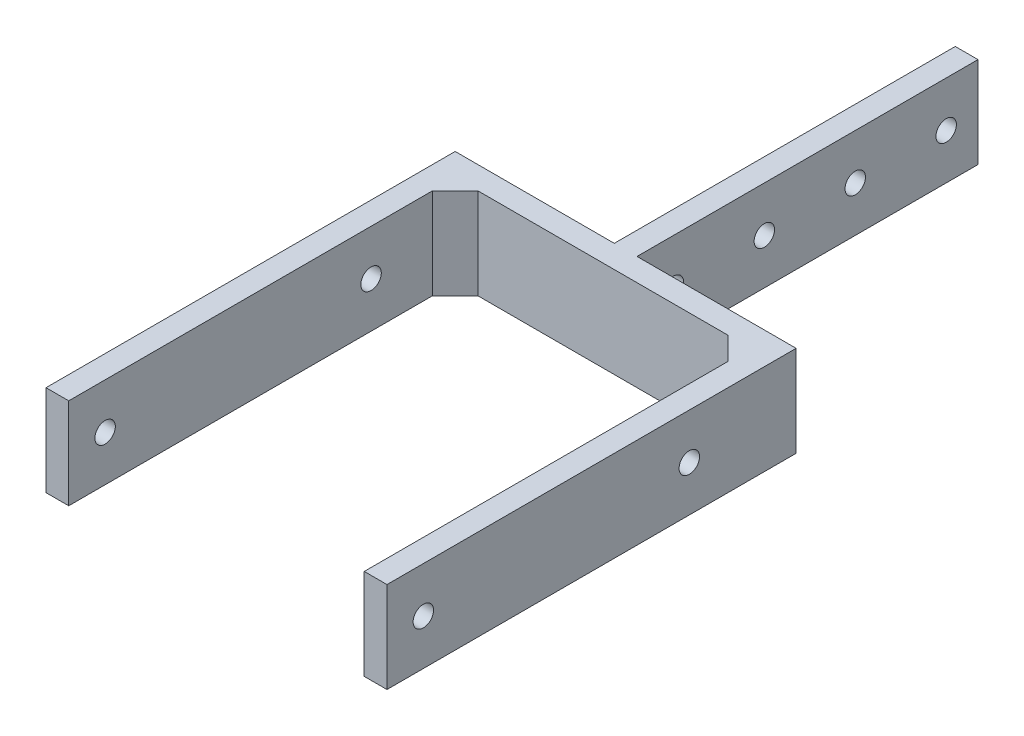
ISO-10303-21;
HEADER;
FILE_DESCRIPTION(('STEP AP214'),'2;1');
FILE_NAME('part.step','',(''),(''),'','','');
FILE_SCHEMA(('AUTOMOTIVE_DESIGN { 1 0 10303 214 1 1 1 1 }'));
ENDSEC;
DATA;
#1=APPLICATION_CONTEXT('core data for automotive mechanical design processes');
#2=APPLICATION_PROTOCOL_DEFINITION('international standard','automotive_design',2000,#1);
#3=PRODUCT_CONTEXT('',#1,'mechanical');
#4=PRODUCT('Part','Part','',(#3));
#5=PRODUCT_RELATED_PRODUCT_CATEGORY('part','',(#4));
#6=PRODUCT_DEFINITION_FORMATION('','',#4);
#7=PRODUCT_DEFINITION_CONTEXT('part definition',#1,'design');
#8=PRODUCT_DEFINITION('design','',#6,#7);
#9=PRODUCT_DEFINITION_SHAPE('','',#8);
#10=(LENGTH_UNIT() NAMED_UNIT(*) SI_UNIT(.MILLI.,.METRE.));
#11=(NAMED_UNIT(*) PLANE_ANGLE_UNIT() SI_UNIT($,.RADIAN.));
#12=(NAMED_UNIT(*) SI_UNIT($,.STERADIAN.) SOLID_ANGLE_UNIT());
#13=UNCERTAINTY_MEASURE_WITH_UNIT(LENGTH_MEASURE(1.E-05),#10,'distance_accuracy_value','');
#14=(GEOMETRIC_REPRESENTATION_CONTEXT(3) GLOBAL_UNCERTAINTY_ASSIGNED_CONTEXT((#13)) GLOBAL_UNIT_ASSIGNED_CONTEXT((#10,
#11,#12)) REPRESENTATION_CONTEXT('',''));
#15=CARTESIAN_POINT('',(0.,0.,0.));
#16=DIRECTION('',(0.,0.,1.));
#17=DIRECTION('',(1.,0.,0.));
#18=AXIS2_PLACEMENT_3D('',#15,#16,#17);
#19=CARTESIAN_POINT('',(75.,9.99999999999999,-98.));
#20=DIRECTION('',(-1.,0.,0.));
#21=DIRECTION('',(0.,-1.,0.));
#22=AXIS2_PLACEMENT_3D('',#19,#20,#21);
#23=CYLINDRICAL_SURFACE('',#22,2.25000000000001);
#24=CARTESIAN_POINT('',(35.,10.,-98.));
#25=DIRECTION('',(-1.,0.,0.));
#26=DIRECTION('',(0.,-1.,0.));
#27=AXIS2_PLACEMENT_3D('',#24,#25,#26);
#28=CIRCLE('',#27,2.25000000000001);
#29=CARTESIAN_POINT('',(35.,7.74999999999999,-98.));
#30=VERTEX_POINT('',#29);
#31=EDGE_CURVE('E47',#30,#30,#28,.T.);
#32=ORIENTED_EDGE('',*,*,#31,.T.);
#33=EDGE_LOOP('',(#32));
#34=FACE_BOUND('',#33,.T.);
#35=CARTESIAN_POINT('',(40.,10.,-98.));
#36=DIRECTION('',(-1.,0.,0.));
#37=DIRECTION('',(0.,0.,1.));
#38=AXIS2_PLACEMENT_3D('',#35,#36,#37);
#39=CIRCLE('',#38,2.25000000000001);
#40=CARTESIAN_POINT('',(40.,10.,-95.75));
#41=VERTEX_POINT('',#40);
#42=EDGE_CURVE('E11',#41,#41,#39,.T.);
#43=ORIENTED_EDGE('',*,*,#42,.F.);
#44=EDGE_LOOP('',(#43));
#45=FACE_BOUND('',#44,.T.);
#46=ADVANCED_FACE('F39',(#34,#45),#23,.F.);
#47=CARTESIAN_POINT('',(75.,9.99999999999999,-118.));
#48=DIRECTION('',(-1.,0.,0.));
#49=DIRECTION('',(0.,-1.,0.));
#50=AXIS2_PLACEMENT_3D('',#47,#48,#49);
#51=CYLINDRICAL_SURFACE('',#50,2.25000000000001);
#52=CARTESIAN_POINT('',(35.,10.,-118.));
#53=DIRECTION('',(-1.,0.,0.));
#54=DIRECTION('',(0.,-1.,0.));
#55=AXIS2_PLACEMENT_3D('',#52,#53,#54);
#56=CIRCLE('',#55,2.25000000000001);
#57=CARTESIAN_POINT('',(35.,7.74999999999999,-118.));
#58=VERTEX_POINT('',#57);
#59=EDGE_CURVE('E308',#58,#58,#56,.T.);
#60=ORIENTED_EDGE('',*,*,#59,.T.);
#61=EDGE_LOOP('',(#60));
#62=FACE_BOUND('',#61,.T.);
#63=CARTESIAN_POINT('',(40.,10.,-118.));
#64=DIRECTION('',(-1.,0.,0.));
#65=DIRECTION('',(0.,0.,1.));
#66=AXIS2_PLACEMENT_3D('',#63,#64,#65);
#67=CIRCLE('',#66,2.25000000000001);
#68=CARTESIAN_POINT('',(40.,10.,-115.75));
#69=VERTEX_POINT('',#68);
#70=EDGE_CURVE('E312',#69,#69,#67,.T.);
#71=ORIENTED_EDGE('',*,*,#70,.F.);
#72=EDGE_LOOP('',(#71));
#73=FACE_BOUND('',#72,.T.);
#74=ADVANCED_FACE('F337',(#62,#73),#51,.F.);
#75=CARTESIAN_POINT('',(0.,20.,-90.));
#76=DIRECTION('',(0.,0.,1.));
#77=DIRECTION('',(1.,0.,0.));
#78=AXIS2_PLACEMENT_3D('',#75,#76,#77);
#79=PLANE('',#78);
#80=DIRECTION('',(0.,-1.,0.));
#81=VECTOR('',#80,1.);
#82=CARTESIAN_POINT('',(40.,0.,-90.));
#83=LINE('',#82,#81);
#84=CARTESIAN_POINT('',(40.,20.,-90.));
#85=VERTEX_POINT('',#84);
#86=CARTESIAN_POINT('',(40.,0.,-90.));
#87=VERTEX_POINT('',#86);
#88=EDGE_CURVE('E54',#85,#87,#83,.T.);
#89=ORIENTED_EDGE('',*,*,#88,.F.);
#90=DIRECTION('',(-1.,0.,0.));
#91=VECTOR('',#90,1.);
#92=CARTESIAN_POINT('',(0.,20.,-90.));
#93=LINE('',#92,#91);
#94=CARTESIAN_POINT('',(75.,20.,-90.));
#95=VERTEX_POINT('',#94);
#96=EDGE_CURVE('E243',#95,#85,#93,.T.);
#97=ORIENTED_EDGE('',*,*,#96,.F.);
#98=DIRECTION('',(0.,-1.,0.));
#99=VECTOR('',#98,1.);
#100=CARTESIAN_POINT('',(75.,20.,-90.));
#101=LINE('',#100,#99);
#102=CARTESIAN_POINT('',(75.,0.,-90.));
#103=VERTEX_POINT('',#102);
#104=EDGE_CURVE('E264',#95,#103,#101,.T.);
#105=ORIENTED_EDGE('',*,*,#104,.T.);
#106=DIRECTION('',(-1.,0.,0.));
#107=VECTOR('',#106,1.);
#108=CARTESIAN_POINT('',(0.,0.,-90.));
#109=LINE('',#108,#107);
#110=EDGE_CURVE('E234',#103,#87,#109,.T.);
#111=ORIENTED_EDGE('',*,*,#110,.T.);
#112=EDGE_LOOP('',(#89,#97,#105,#111));
#113=FACE_BOUND('',#112,.T.);
#114=ADVANCED_FACE('F341',(#113),#79,.F.);
#115=DIRECTION('',(0.,1.,0.));
#116=VECTOR('',#115,1.);
#117=CARTESIAN_POINT('',(35.,0.,-90.));
#118=LINE('',#117,#116);
#119=CARTESIAN_POINT('',(35.,0.,-90.));
#120=VERTEX_POINT('',#119);
#121=CARTESIAN_POINT('',(35.,20.,-90.));
#122=VERTEX_POINT('',#121);
#123=EDGE_CURVE('E62',#120,#122,#118,.T.);
#124=ORIENTED_EDGE('',*,*,#123,.F.);
#125=CARTESIAN_POINT('',(0.,0.,-90.));
#126=VERTEX_POINT('',#125);
#127=EDGE_CURVE('E258',#120,#126,#109,.T.);
#128=ORIENTED_EDGE('',*,*,#127,.T.);
#129=DIRECTION('',(0.,-1.,0.));
#130=VECTOR('',#129,1.);
#131=CARTESIAN_POINT('',(0.,20.,-90.));
#132=LINE('',#131,#130);
#133=CARTESIAN_POINT('',(0.,20.,-90.));
#134=VERTEX_POINT('',#133);
#135=EDGE_CURVE('E246',#134,#126,#132,.T.);
#136=ORIENTED_EDGE('',*,*,#135,.F.);
#137=EDGE_CURVE('E242',#122,#134,#93,.T.);
#138=ORIENTED_EDGE('',*,*,#137,.F.);
#139=EDGE_LOOP('',(#124,#128,#136,#138));
#140=FACE_BOUND('',#139,.T.);
#141=ADVANCED_FACE('F346',(#140),#79,.F.);
#142=CARTESIAN_POINT('',(0.,20.,0.));
#143=DIRECTION('',(0.,0.,-1.));
#144=DIRECTION('',(-1.,0.,0.));
#145=AXIS2_PLACEMENT_3D('',#142,#143,#144);
#146=PLANE('',#145);
#147=DIRECTION('',(1.,0.,0.));
#148=VECTOR('',#147,1.);
#149=CARTESIAN_POINT('',(0.,0.,0.));
#150=LINE('',#149,#148);
#151=CARTESIAN_POINT('',(0.,0.,0.));
#152=VERTEX_POINT('',#151);
#153=CARTESIAN_POINT('',(5.,0.,0.));
#154=VERTEX_POINT('',#153);
#155=EDGE_CURVE('E251',#152,#154,#150,.T.);
#156=ORIENTED_EDGE('',*,*,#155,.T.);
#157=DIRECTION('',(0.,1.,0.));
#158=VECTOR('',#157,1.);
#159=CARTESIAN_POINT('',(5.,0.,0.));
#160=LINE('',#159,#158);
#161=CARTESIAN_POINT('',(5.,20.,0.));
#162=VERTEX_POINT('',#161);
#163=EDGE_CURVE('E212',#154,#162,#160,.T.);
#164=ORIENTED_EDGE('',*,*,#163,.T.);
#165=DIRECTION('',(1.,0.,0.));
#166=VECTOR('',#165,1.);
#167=CARTESIAN_POINT('',(0.,20.,0.));
#168=LINE('',#167,#166);
#169=CARTESIAN_POINT('',(0.,20.,0.));
#170=VERTEX_POINT('',#169);
#171=EDGE_CURVE('E235',#170,#162,#168,.T.);
#172=ORIENTED_EDGE('',*,*,#171,.F.);
#173=DIRECTION('',(0.,-1.,0.));
#174=VECTOR('',#173,1.);
#175=CARTESIAN_POINT('',(0.,20.,0.));
#176=LINE('',#175,#174);
#177=EDGE_CURVE('E272',#170,#152,#176,.T.);
#178=ORIENTED_EDGE('',*,*,#177,.T.);
#179=EDGE_LOOP('',(#156,#164,#172,#178));
#180=FACE_BOUND('',#179,.T.);
#181=ADVANCED_FACE('F362',(#180),#146,.F.);
#182=CARTESIAN_POINT('',(0.,20.,0.));
#183=DIRECTION('',(1.,0.,0.));
#184=DIRECTION('',(0.,0.,-1.));
#185=AXIS2_PLACEMENT_3D('',#182,#183,#184);
#186=PLANE('',#185);
#187=CARTESIAN_POINT('',(0.,10.,-66.5));
#188=DIRECTION('',(-1.,0.,0.));
#189=DIRECTION('',(0.,0.,1.));
#190=AXIS2_PLACEMENT_3D('',#187,#188,#189);
#191=CIRCLE('',#190,2.25);
#192=CARTESIAN_POINT('',(0.,10.,-64.25));
#193=VERTEX_POINT('',#192);
#194=EDGE_CURVE('E168',#193,#193,#191,.T.);
#195=ORIENTED_EDGE('',*,*,#194,.F.);
#196=EDGE_LOOP('',(#195));
#197=FACE_BOUND('',#196,.T.);
#198=CARTESIAN_POINT('',(0.,10.,-8.));
#199=DIRECTION('',(-1.,0.,0.));
#200=DIRECTION('',(0.,0.,1.));
#201=AXIS2_PLACEMENT_3D('',#198,#199,#200);
#202=CIRCLE('',#201,2.25);
#203=CARTESIAN_POINT('',(0.,10.,-5.75));
#204=VERTEX_POINT('',#203);
#205=EDGE_CURVE('E187',#204,#204,#202,.T.);
#206=ORIENTED_EDGE('',*,*,#205,.F.);
#207=EDGE_LOOP('',(#206));
#208=FACE_BOUND('',#207,.T.);
#209=DIRECTION('',(0.,0.,1.));
#210=VECTOR('',#209,1.);
#211=CARTESIAN_POINT('',(0.,0.,0.));
#212=LINE('',#211,#210);
#213=EDGE_CURVE('E225',#126,#152,#212,.T.);
#214=ORIENTED_EDGE('',*,*,#213,.T.);
#215=ORIENTED_EDGE('',*,*,#177,.F.);
#216=DIRECTION('',(0.,0.,1.));
#217=VECTOR('',#216,1.);
#218=CARTESIAN_POINT('',(0.,20.,0.));
#219=LINE('',#218,#217);
#220=EDGE_CURVE('E229',#134,#170,#219,.T.);
#221=ORIENTED_EDGE('',*,*,#220,.F.);
#222=ORIENTED_EDGE('',*,*,#135,.T.);
#223=EDGE_LOOP('',(#214,#215,#221,#222));
#224=FACE_BOUND('',#223,.T.);
#225=ADVANCED_FACE('F358',(#197,#208,#224),#186,.F.);
#226=CARTESIAN_POINT('',(70.,20.,0.));
#227=VERTEX_POINT('',#226);
#228=CARTESIAN_POINT('',(75.,20.,0.));
#229=VERTEX_POINT('',#228);
#230=EDGE_CURVE('E233',#227,#229,#168,.T.);
#231=ORIENTED_EDGE('',*,*,#230,.F.);
#232=DIRECTION('',(0.,1.,0.));
#233=VECTOR('',#232,1.);
#234=CARTESIAN_POINT('',(70.,0.,0.));
#235=LINE('',#234,#233);
#236=CARTESIAN_POINT('',(70.,0.,0.));
#237=VERTEX_POINT('',#236);
#238=EDGE_CURVE('E222',#237,#227,#235,.T.);
#239=ORIENTED_EDGE('',*,*,#238,.F.);
#240=CARTESIAN_POINT('',(75.,0.,0.));
#241=VERTEX_POINT('',#240);
#242=EDGE_CURVE('E250',#237,#241,#150,.T.);
#243=ORIENTED_EDGE('',*,*,#242,.T.);
#244=DIRECTION('',(0.,-1.,0.));
#245=VECTOR('',#244,1.);
#246=CARTESIAN_POINT('',(75.,20.,0.));
#247=LINE('',#246,#245);
#248=EDGE_CURVE('E268',#229,#241,#247,.T.);
#249=ORIENTED_EDGE('',*,*,#248,.F.);
#250=EDGE_LOOP('',(#231,#239,#243,#249));
#251=FACE_BOUND('',#250,.T.);
#252=ADVANCED_FACE('F361',(#251),#146,.F.);
#253=CARTESIAN_POINT('',(75.,20.,0.));
#254=DIRECTION('',(-1.,0.,0.));
#255=DIRECTION('',(0.,0.,1.));
#256=AXIS2_PLACEMENT_3D('',#253,#254,#255);
#257=PLANE('',#256);
#258=CARTESIAN_POINT('',(75.,10.,-66.5));
#259=DIRECTION('',(-1.,0.,0.));
#260=DIRECTION('',(0.,0.,1.));
#261=AXIS2_PLACEMENT_3D('',#258,#259,#260);
#262=CIRCLE('',#261,2.25);
#263=CARTESIAN_POINT('',(75.,10.,-64.25));
#264=VERTEX_POINT('',#263);
#265=EDGE_CURVE('E173',#264,#264,#262,.T.);
#266=ORIENTED_EDGE('',*,*,#265,.T.);
#267=EDGE_LOOP('',(#266));
#268=FACE_BOUND('',#267,.T.);
#269=CARTESIAN_POINT('',(75.,10.,-8.));
#270=DIRECTION('',(-1.,0.,0.));
#271=DIRECTION('',(0.,0.,1.));
#272=AXIS2_PLACEMENT_3D('',#269,#270,#271);
#273=CIRCLE('',#272,2.25);
#274=CARTESIAN_POINT('',(75.,10.,-5.75));
#275=VERTEX_POINT('',#274);
#276=EDGE_CURVE('E188',#275,#275,#273,.T.);
#277=ORIENTED_EDGE('',*,*,#276,.T.);
#278=EDGE_LOOP('',(#277));
#279=FACE_BOUND('',#278,.T.);
#280=DIRECTION('',(0.,0.,-1.));
#281=VECTOR('',#280,1.);
#282=CARTESIAN_POINT('',(75.,0.,0.));
#283=LINE('',#282,#281);
#284=EDGE_CURVE('E255',#241,#103,#283,.T.);
#285=ORIENTED_EDGE('',*,*,#284,.T.);
#286=ORIENTED_EDGE('',*,*,#104,.F.);
#287=DIRECTION('',(0.,0.,-1.));
#288=VECTOR('',#287,1.);
#289=CARTESIAN_POINT('',(75.,20.,0.));
#290=LINE('',#289,#288);
#291=EDGE_CURVE('E239',#229,#95,#290,.T.);
#292=ORIENTED_EDGE('',*,*,#291,.F.);
#293=ORIENTED_EDGE('',*,*,#248,.T.);
#294=EDGE_LOOP('',(#285,#286,#292,#293));
#295=FACE_BOUND('',#294,.T.);
#296=ADVANCED_FACE('F366',(#268,#279,#295),#257,.F.);
#297=CARTESIAN_POINT('',(0.,20.,0.));
#298=DIRECTION('',(0.,-1.,0.));
#299=DIRECTION('',(0.,0.,-1.));
#300=AXIS2_PLACEMENT_3D('',#297,#298,#299);
#301=PLANE('',#300);
#302=ORIENTED_EDGE('',*,*,#171,.T.);
#303=DIRECTION('',(0.,0.,1.));
#304=VECTOR('',#303,1.);
#305=CARTESIAN_POINT('',(5.,20.,0.));
#306=LINE('',#305,#304);
#307=CARTESIAN_POINT('',(5.,20.,-80.));
#308=VERTEX_POINT('',#307);
#309=EDGE_CURVE('E200',#308,#162,#306,.T.);
#310=ORIENTED_EDGE('',*,*,#309,.F.);
#311=DIRECTION('',(-0.707106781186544,0.,0.707106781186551));
#312=VECTOR('',#311,1.);
#313=CARTESIAN_POINT('',(-37.5,20.,-37.4999999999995));
#314=LINE('',#313,#312);
#315=CARTESIAN_POINT('',(9.99999999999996,20.,-85.));
#316=VERTEX_POINT('',#315);
#317=EDGE_CURVE('E302',#308,#316,#314,.F.);
#318=ORIENTED_EDGE('',*,*,#317,.T.);
#319=DIRECTION('',(-1.,0.,0.));
#320=VECTOR('',#319,1.);
#321=CARTESIAN_POINT('',(5.,20.,-85.));
#322=LINE('',#321,#320);
#323=CARTESIAN_POINT('',(65.,20.,-85.));
#324=VERTEX_POINT('',#323);
#325=EDGE_CURVE('E205',#324,#316,#322,.T.);
#326=ORIENTED_EDGE('',*,*,#325,.F.);
#327=DIRECTION('',(-0.707106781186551,0.,-0.707106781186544));
#328=VECTOR('',#327,1.);
#329=CARTESIAN_POINT('',(74.9999999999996,20.,-75.0000000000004));
#330=LINE('',#329,#328);
#331=CARTESIAN_POINT('',(70.,20.,-80.));
#332=VERTEX_POINT('',#331);
#333=EDGE_CURVE('E296',#324,#332,#330,.F.);
#334=ORIENTED_EDGE('',*,*,#333,.T.);
#335=DIRECTION('',(0.,0.,-1.));
#336=VECTOR('',#335,1.);
#337=CARTESIAN_POINT('',(70.,20.,0.));
#338=LINE('',#337,#336);
#339=EDGE_CURVE('E215',#227,#332,#338,.T.);
#340=ORIENTED_EDGE('',*,*,#339,.F.);
#341=ORIENTED_EDGE('',*,*,#230,.T.);
#342=ORIENTED_EDGE('',*,*,#291,.T.);
#343=ORIENTED_EDGE('',*,*,#96,.T.);
#344=DIRECTION('',(0.,0.,1.));
#345=VECTOR('',#344,1.);
#346=CARTESIAN_POINT('',(40.,20.,-165.));
#347=LINE('',#346,#345);
#348=CARTESIAN_POINT('',(40.,20.,-165.));
#349=VERTEX_POINT('',#348);
#350=EDGE_CURVE('E442',#349,#85,#347,.T.);
#351=ORIENTED_EDGE('',*,*,#350,.F.);
#352=DIRECTION('',(1.,0.,0.));
#353=VECTOR('',#352,1.);
#354=CARTESIAN_POINT('',(40.,20.,-165.));
#355=LINE('',#354,#353);
#356=CARTESIAN_POINT('',(35.,20.,-165.));
#357=VERTEX_POINT('',#356);
#358=EDGE_CURVE('E159',#357,#349,#355,.T.);
#359=ORIENTED_EDGE('',*,*,#358,.F.);
#360=DIRECTION('',(0.,0.,1.));
#361=VECTOR('',#360,1.);
#362=CARTESIAN_POINT('',(35.,20.,-165.));
#363=LINE('',#362,#361);
#364=EDGE_CURVE('E175',#357,#122,#363,.T.);
#365=ORIENTED_EDGE('',*,*,#364,.T.);
#366=ORIENTED_EDGE('',*,*,#137,.T.);
#367=ORIENTED_EDGE('',*,*,#220,.T.);
#368=EDGE_LOOP('',(#302,#310,#318,#326,#334,#340,#341,#342,#343,#351,#359,#365,#366,#367));
#369=FACE_BOUND('',#368,.T.);
#370=ADVANCED_FACE('F369',(#369),#301,.F.);
#371=CARTESIAN_POINT('',(0.,0.,0.));
#372=DIRECTION('',(0.,-1.,0.));
#373=DIRECTION('',(0.,0.,-1.));
#374=AXIS2_PLACEMENT_3D('',#371,#372,#373);
#375=PLANE('',#374);
#376=DIRECTION('',(-1.,0.,0.));
#377=VECTOR('',#376,1.);
#378=CARTESIAN_POINT('',(5.,0.,-85.));
#379=LINE('',#378,#377);
#380=CARTESIAN_POINT('',(65.,0.,-85.));
#381=VERTEX_POINT('',#380);
#382=CARTESIAN_POINT('',(9.99999999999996,0.,-85.));
#383=VERTEX_POINT('',#382);
#384=EDGE_CURVE('E209',#381,#383,#379,.T.);
#385=ORIENTED_EDGE('',*,*,#384,.T.);
#386=DIRECTION('',(0.707106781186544,0.,-0.707106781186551));
#387=VECTOR('',#386,1.);
#388=CARTESIAN_POINT('',(5.,0.,-80.));
#389=LINE('',#388,#387);
#390=CARTESIAN_POINT('',(5.,0.,-80.));
#391=VERTEX_POINT('',#390);
#392=EDGE_CURVE('E305',#383,#391,#389,.F.);
#393=ORIENTED_EDGE('',*,*,#392,.T.);
#394=DIRECTION('',(0.,0.,1.));
#395=VECTOR('',#394,1.);
#396=CARTESIAN_POINT('',(5.,0.,0.));
#397=LINE('',#396,#395);
#398=EDGE_CURVE('E201',#391,#154,#397,.T.);
#399=ORIENTED_EDGE('',*,*,#398,.T.);
#400=ORIENTED_EDGE('',*,*,#155,.F.);
#401=ORIENTED_EDGE('',*,*,#213,.F.);
#402=ORIENTED_EDGE('',*,*,#127,.F.);
#403=DIRECTION('',(0.,0.,1.));
#404=VECTOR('',#403,1.);
#405=CARTESIAN_POINT('',(35.,0.,-165.));
#406=LINE('',#405,#404);
#407=CARTESIAN_POINT('',(35.,0.,-165.));
#408=VERTEX_POINT('',#407);
#409=EDGE_CURVE('E149',#408,#120,#406,.T.);
#410=ORIENTED_EDGE('',*,*,#409,.F.);
#411=DIRECTION('',(-1.,0.,0.));
#412=VECTOR('',#411,1.);
#413=CARTESIAN_POINT('',(40.,0.,-165.));
#414=LINE('',#413,#412);
#415=CARTESIAN_POINT('',(40.,0.,-165.));
#416=VERTEX_POINT('',#415);
#417=EDGE_CURVE('E141',#416,#408,#414,.T.);
#418=ORIENTED_EDGE('',*,*,#417,.F.);
#419=DIRECTION('',(0.,0.,1.));
#420=VECTOR('',#419,1.);
#421=CARTESIAN_POINT('',(40.,0.,-165.));
#422=LINE('',#421,#420);
#423=EDGE_CURVE('E147',#416,#87,#422,.T.);
#424=ORIENTED_EDGE('',*,*,#423,.T.);
#425=ORIENTED_EDGE('',*,*,#110,.F.);
#426=ORIENTED_EDGE('',*,*,#284,.F.);
#427=ORIENTED_EDGE('',*,*,#242,.F.);
#428=DIRECTION('',(0.,0.,-1.));
#429=VECTOR('',#428,1.);
#430=CARTESIAN_POINT('',(70.,0.,0.));
#431=LINE('',#430,#429);
#432=CARTESIAN_POINT('',(70.,0.,-80.));
#433=VERTEX_POINT('',#432);
#434=EDGE_CURVE('E204',#237,#433,#431,.T.);
#435=ORIENTED_EDGE('',*,*,#434,.T.);
#436=DIRECTION('',(0.707106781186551,0.,0.707106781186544));
#437=VECTOR('',#436,1.);
#438=CARTESIAN_POINT('',(65.,0.,-85.));
#439=LINE('',#438,#437);
#440=EDGE_CURVE('E299',#433,#381,#439,.F.);
#441=ORIENTED_EDGE('',*,*,#440,.T.);
#442=EDGE_LOOP('',(#385,#393,#399,#400,#401,#402,#410,#418,#424,#425,#426,#427,#435,#441));
#443=FACE_BOUND('',#442,.T.);
#444=ADVANCED_FACE('F144',(#443),#375,.T.);
#445=CARTESIAN_POINT('',(5.,0.,0.));
#446=DIRECTION('',(-1.,0.,0.));
#447=DIRECTION('',(0.,0.,1.));
#448=AXIS2_PLACEMENT_3D('',#445,#446,#447);
#449=PLANE('',#448);
#450=CARTESIAN_POINT('',(5.,10.,-66.5));
#451=DIRECTION('',(-1.,0.,0.));
#452=DIRECTION('',(0.,0.,1.));
#453=AXIS2_PLACEMENT_3D('',#450,#451,#452);
#454=CIRCLE('',#453,2.25);
#455=CARTESIAN_POINT('',(5.,10.,-64.25));
#456=VERTEX_POINT('',#455);
#457=EDGE_CURVE('E183',#456,#456,#454,.T.);
#458=ORIENTED_EDGE('',*,*,#457,.T.);
#459=EDGE_LOOP('',(#458));
#460=FACE_BOUND('',#459,.T.);
#461=CARTESIAN_POINT('',(5.,10.,-8.));
#462=DIRECTION('',(-1.,0.,0.));
#463=DIRECTION('',(0.,0.,1.));
#464=AXIS2_PLACEMENT_3D('',#461,#462,#463);
#465=CIRCLE('',#464,2.25);
#466=CARTESIAN_POINT('',(5.,10.,-5.75));
#467=VERTEX_POINT('',#466);
#468=EDGE_CURVE('E196',#467,#467,#465,.T.);
#469=ORIENTED_EDGE('',*,*,#468,.T.);
#470=EDGE_LOOP('',(#469));
#471=FACE_BOUND('',#470,.T.);
#472=ORIENTED_EDGE('',*,*,#398,.F.);
#473=DIRECTION('',(0.,1.,0.));
#474=VECTOR('',#473,1.);
#475=CARTESIAN_POINT('',(5.,20.,-80.));
#476=LINE('',#475,#474);
#477=EDGE_CURVE('E292',#391,#308,#476,.T.);
#478=ORIENTED_EDGE('',*,*,#477,.T.);
#479=ORIENTED_EDGE('',*,*,#309,.T.);
#480=ORIENTED_EDGE('',*,*,#163,.F.);
#481=EDGE_LOOP('',(#472,#478,#479,#480));
#482=FACE_BOUND('',#481,.T.);
#483=ADVANCED_FACE('F374',(#460,#471,#482),#449,.F.);
#484=CARTESIAN_POINT('',(5.,0.,-85.));
#485=DIRECTION('',(0.,0.,-1.));
#486=DIRECTION('',(-1.,0.,0.));
#487=AXIS2_PLACEMENT_3D('',#484,#485,#486);
#488=PLANE('',#487);
#489=ORIENTED_EDGE('',*,*,#384,.F.);
#490=DIRECTION('',(0.,1.,0.));
#491=VECTOR('',#490,1.);
#492=CARTESIAN_POINT('',(65.,20.,-85.));
#493=LINE('',#492,#491);
#494=EDGE_CURVE('E285',#381,#324,#493,.T.);
#495=ORIENTED_EDGE('',*,*,#494,.T.);
#496=ORIENTED_EDGE('',*,*,#325,.T.);
#497=DIRECTION('',(0.,-1.,0.));
#498=VECTOR('',#497,1.);
#499=CARTESIAN_POINT('',(9.99999999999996,0.,-85.));
#500=LINE('',#499,#498);
#501=EDGE_CURVE('E276',#316,#383,#500,.T.);
#502=ORIENTED_EDGE('',*,*,#501,.T.);
#503=EDGE_LOOP('',(#489,#495,#496,#502));
#504=FACE_BOUND('',#503,.T.);
#505=ADVANCED_FACE('F380',(#504),#488,.F.);
#506=CARTESIAN_POINT('',(70.,0.,0.));
#507=DIRECTION('',(1.,0.,0.));
#508=DIRECTION('',(0.,0.,-1.));
#509=AXIS2_PLACEMENT_3D('',#506,#507,#508);
#510=PLANE('',#509);
#511=CARTESIAN_POINT('',(70.,10.,-66.5));
#512=DIRECTION('',(1.,0.,0.));
#513=DIRECTION('',(0.,0.,-1.));
#514=AXIS2_PLACEMENT_3D('',#511,#512,#513);
#515=CIRCLE('',#514,2.25);
#516=CARTESIAN_POINT('',(70.,10.,-68.75));
#517=VERTEX_POINT('',#516);
#518=EDGE_CURVE('E181',#517,#517,#515,.T.);
#519=ORIENTED_EDGE('',*,*,#518,.T.);
#520=EDGE_LOOP('',(#519));
#521=FACE_BOUND('',#520,.T.);
#522=CARTESIAN_POINT('',(70.,10.,-8.));
#523=DIRECTION('',(1.,0.,0.));
#524=DIRECTION('',(0.,0.,-1.));
#525=AXIS2_PLACEMENT_3D('',#522,#523,#524);
#526=CIRCLE('',#525,2.25);
#527=CARTESIAN_POINT('',(70.,10.,-10.25));
#528=VERTEX_POINT('',#527);
#529=EDGE_CURVE('E192',#528,#528,#526,.T.);
#530=ORIENTED_EDGE('',*,*,#529,.T.);
#531=EDGE_LOOP('',(#530));
#532=FACE_BOUND('',#531,.T.);
#533=ORIENTED_EDGE('',*,*,#339,.T.);
#534=DIRECTION('',(0.,-1.,0.));
#535=VECTOR('',#534,1.);
#536=CARTESIAN_POINT('',(70.,0.,-80.));
#537=LINE('',#536,#535);
#538=EDGE_CURVE('E289',#332,#433,#537,.T.);
#539=ORIENTED_EDGE('',*,*,#538,.T.);
#540=ORIENTED_EDGE('',*,*,#434,.F.);
#541=ORIENTED_EDGE('',*,*,#238,.T.);
#542=EDGE_LOOP('',(#533,#539,#540,#541));
#543=FACE_BOUND('',#542,.T.);
#544=ADVANCED_FACE('F382',(#521,#532,#543),#510,.F.);
#545=CARTESIAN_POINT('',(75.,10.,-8.));
#546=DIRECTION('',(-1.,0.,0.));
#547=DIRECTION('',(0.,0.,1.));
#548=AXIS2_PLACEMENT_3D('',#545,#546,#547);
#549=CYLINDRICAL_SURFACE('',#548,2.25);
#550=ORIENTED_EDGE('',*,*,#276,.F.);
#551=EDGE_LOOP('',(#550));
#552=FACE_BOUND('',#551,.T.);
#553=ORIENTED_EDGE('',*,*,#529,.F.);
#554=EDGE_LOOP('',(#553));
#555=FACE_BOUND('',#554,.T.);
#556=ADVANCED_FACE('F385',(#552,#555),#549,.F.);
#557=ORIENTED_EDGE('',*,*,#205,.T.);
#558=EDGE_LOOP('',(#557));
#559=FACE_BOUND('',#558,.T.);
#560=ORIENTED_EDGE('',*,*,#468,.F.);
#561=EDGE_LOOP('',(#560));
#562=FACE_BOUND('',#561,.T.);
#563=ADVANCED_FACE('F390',(#559,#562),#549,.F.);
#564=CARTESIAN_POINT('',(75.,10.,-66.5));
#565=DIRECTION('',(-1.,0.,0.));
#566=DIRECTION('',(0.,0.,1.));
#567=AXIS2_PLACEMENT_3D('',#564,#565,#566);
#568=CYLINDRICAL_SURFACE('',#567,2.25);
#569=ORIENTED_EDGE('',*,*,#265,.F.);
#570=EDGE_LOOP('',(#569));
#571=FACE_BOUND('',#570,.T.);
#572=ORIENTED_EDGE('',*,*,#518,.F.);
#573=EDGE_LOOP('',(#572));
#574=FACE_BOUND('',#573,.T.);
#575=ADVANCED_FACE('F393',(#571,#574),#568,.F.);
#576=ORIENTED_EDGE('',*,*,#194,.T.);
#577=EDGE_LOOP('',(#576));
#578=FACE_BOUND('',#577,.T.);
#579=ORIENTED_EDGE('',*,*,#457,.F.);
#580=EDGE_LOOP('',(#579));
#581=FACE_BOUND('',#580,.T.);
#582=ADVANCED_FACE('F356',(#578,#581),#568,.F.);
#583=CARTESIAN_POINT('',(65.,0.,-85.));
#584=DIRECTION('',(-0.707106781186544,0.,0.707106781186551));
#585=DIRECTION('',(0.,-1.,0.));
#586=AXIS2_PLACEMENT_3D('',#583,#584,#585);
#587=PLANE('',#586);
#588=ORIENTED_EDGE('',*,*,#440,.F.);
#589=ORIENTED_EDGE('',*,*,#538,.F.);
#590=ORIENTED_EDGE('',*,*,#333,.F.);
#591=ORIENTED_EDGE('',*,*,#494,.F.);
#592=EDGE_LOOP('',(#588,#589,#590,#591));
#593=FACE_BOUND('',#592,.T.);
#594=ADVANCED_FACE('F352',(#593),#587,.T.);
#595=CARTESIAN_POINT('',(5.,0.,-80.));
#596=DIRECTION('',(0.707106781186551,0.,0.707106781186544));
#597=DIRECTION('',(0.,-1.,0.));
#598=AXIS2_PLACEMENT_3D('',#595,#596,#597);
#599=PLANE('',#598);
#600=ORIENTED_EDGE('',*,*,#392,.F.);
#601=ORIENTED_EDGE('',*,*,#501,.F.);
#602=ORIENTED_EDGE('',*,*,#317,.F.);
#603=ORIENTED_EDGE('',*,*,#477,.F.);
#604=EDGE_LOOP('',(#600,#601,#602,#603));
#605=FACE_BOUND('',#604,.T.);
#606=ADVANCED_FACE('F331',(#605),#599,.T.);
#607=CARTESIAN_POINT('',(40.,0.,-165.));
#608=DIRECTION('',(-1.,0.,0.));
#609=DIRECTION('',(0.,0.,1.));
#610=AXIS2_PLACEMENT_3D('',#607,#608,#609);
#611=PLANE('',#610);
#612=CARTESIAN_POINT('',(40.,10.,-138.));
#613=DIRECTION('',(-1.,0.,0.));
#614=DIRECTION('',(0.,0.,1.));
#615=AXIS2_PLACEMENT_3D('',#612,#613,#614);
#616=CIRCLE('',#615,2.25000000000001);
#617=CARTESIAN_POINT('',(40.,10.,-135.75));
#618=VERTEX_POINT('',#617);
#619=EDGE_CURVE('E462',#618,#618,#616,.T.);
#620=ORIENTED_EDGE('',*,*,#619,.T.);
#621=EDGE_LOOP('',(#620));
#622=FACE_BOUND('',#621,.T.);
#623=CARTESIAN_POINT('',(40.,10.,-158.));
#624=DIRECTION('',(-1.,0.,0.));
#625=DIRECTION('',(0.,0.,1.));
#626=AXIS2_PLACEMENT_3D('',#623,#624,#625);
#627=CIRCLE('',#626,2.25000000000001);
#628=CARTESIAN_POINT('',(40.,10.,-155.75));
#629=VERTEX_POINT('',#628);
#630=EDGE_CURVE('E447',#629,#629,#627,.T.);
#631=ORIENTED_EDGE('',*,*,#630,.T.);
#632=EDGE_LOOP('',(#631));
#633=FACE_BOUND('',#632,.T.);
#634=ORIENTED_EDGE('',*,*,#88,.T.);
#635=ORIENTED_EDGE('',*,*,#423,.F.);
#636=DIRECTION('',(0.,-1.,0.));
#637=VECTOR('',#636,1.);
#638=CARTESIAN_POINT('',(40.,0.,-165.));
#639=LINE('',#638,#637);
#640=EDGE_CURVE('E154',#349,#416,#639,.T.);
#641=ORIENTED_EDGE('',*,*,#640,.F.);
#642=ORIENTED_EDGE('',*,*,#350,.T.);
#643=EDGE_LOOP('',(#634,#635,#641,#642));
#644=FACE_BOUND('',#643,.T.);
#645=ORIENTED_EDGE('',*,*,#70,.T.);
#646=EDGE_LOOP('',(#645));
#647=FACE_BOUND('',#646,.T.);
#648=ORIENTED_EDGE('',*,*,#42,.T.);
#649=EDGE_LOOP('',(#648));
#650=FACE_BOUND('',#649,.T.);
#651=ADVANCED_FACE('F165',(#622,#633,#644,#647,#650),#611,.F.);
#652=CARTESIAN_POINT('',(35.,0.,-165.));
#653=DIRECTION('',(1.,0.,0.));
#654=DIRECTION('',(0.,1.,0.));
#655=AXIS2_PLACEMENT_3D('',#652,#653,#654);
#656=PLANE('',#655);
#657=CARTESIAN_POINT('',(35.,10.,-138.));
#658=DIRECTION('',(-1.,0.,0.));
#659=DIRECTION('',(0.,-1.,0.));
#660=AXIS2_PLACEMENT_3D('',#657,#658,#659);
#661=CIRCLE('',#660,2.25000000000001);
#662=CARTESIAN_POINT('',(35.,7.74999999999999,-138.));
#663=VERTEX_POINT('',#662);
#664=EDGE_CURVE('E466',#663,#663,#661,.T.);
#665=ORIENTED_EDGE('',*,*,#664,.F.);
#666=EDGE_LOOP('',(#665));
#667=FACE_BOUND('',#666,.T.);
#668=CARTESIAN_POINT('',(35.,10.,-158.));
#669=DIRECTION('',(-1.,0.,0.));
#670=DIRECTION('',(0.,-1.,0.));
#671=AXIS2_PLACEMENT_3D('',#668,#669,#670);
#672=CIRCLE('',#671,2.25000000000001);
#673=CARTESIAN_POINT('',(35.,7.74999999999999,-158.));
#674=VERTEX_POINT('',#673);
#675=EDGE_CURVE('E458',#674,#674,#672,.T.);
#676=ORIENTED_EDGE('',*,*,#675,.F.);
#677=EDGE_LOOP('',(#676));
#678=FACE_BOUND('',#677,.T.);
#679=ORIENTED_EDGE('',*,*,#123,.T.);
#680=ORIENTED_EDGE('',*,*,#364,.F.);
#681=DIRECTION('',(0.,1.,0.));
#682=VECTOR('',#681,1.);
#683=CARTESIAN_POINT('',(35.,0.,-165.));
#684=LINE('',#683,#682);
#685=EDGE_CURVE('E153',#408,#357,#684,.T.);
#686=ORIENTED_EDGE('',*,*,#685,.F.);
#687=ORIENTED_EDGE('',*,*,#409,.T.);
#688=EDGE_LOOP('',(#679,#680,#686,#687));
#689=FACE_BOUND('',#688,.T.);
#690=ORIENTED_EDGE('',*,*,#59,.F.);
#691=EDGE_LOOP('',(#690));
#692=FACE_BOUND('',#691,.T.);
#693=ORIENTED_EDGE('',*,*,#31,.F.);
#694=EDGE_LOOP('',(#693));
#695=FACE_BOUND('',#694,.T.);
#696=ADVANCED_FACE('F321',(#667,#678,#689,#692,#695),#656,.F.);
#697=CARTESIAN_POINT('',(0.,0.,-165.));
#698=DIRECTION('',(0.,0.,1.));
#699=DIRECTION('',(1.,0.,0.));
#700=AXIS2_PLACEMENT_3D('',#697,#698,#699);
#701=PLANE('',#700);
#702=ORIENTED_EDGE('',*,*,#640,.T.);
#703=ORIENTED_EDGE('',*,*,#417,.T.);
#704=ORIENTED_EDGE('',*,*,#685,.T.);
#705=ORIENTED_EDGE('',*,*,#358,.T.);
#706=EDGE_LOOP('',(#702,#703,#704,#705));
#707=FACE_BOUND('',#706,.T.);
#708=ADVANCED_FACE('F157',(#707),#701,.F.);
#709=CARTESIAN_POINT('',(75.,9.99999999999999,-158.));
#710=DIRECTION('',(-1.,0.,0.));
#711=DIRECTION('',(0.,-1.,0.));
#712=AXIS2_PLACEMENT_3D('',#709,#710,#711);
#713=CYLINDRICAL_SURFACE('',#712,2.25000000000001);
#714=ORIENTED_EDGE('',*,*,#675,.T.);
#715=EDGE_LOOP('',(#714));
#716=FACE_BOUND('',#715,.T.);
#717=ORIENTED_EDGE('',*,*,#630,.F.);
#718=EDGE_LOOP('',(#717));
#719=FACE_BOUND('',#718,.T.);
#720=ADVANCED_FACE('F329',(#716,#719),#713,.F.);
#721=CARTESIAN_POINT('',(75.,9.99999999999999,-138.));
#722=DIRECTION('',(-1.,0.,0.));
#723=DIRECTION('',(0.,-1.,0.));
#724=AXIS2_PLACEMENT_3D('',#721,#722,#723);
#725=CYLINDRICAL_SURFACE('',#724,2.25000000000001);
#726=ORIENTED_EDGE('',*,*,#664,.T.);
#727=EDGE_LOOP('',(#726));
#728=FACE_BOUND('',#727,.T.);
#729=ORIENTED_EDGE('',*,*,#619,.F.);
#730=EDGE_LOOP('',(#729));
#731=FACE_BOUND('',#730,.T.);
#732=ADVANCED_FACE('F471',(#728,#731),#725,.F.);
#733=CLOSED_SHELL('',(#46,#74,#114,#141,#181,#225,#252,#296,#370,#444,#483,#505,#544,#556,#563,
#575,#582,#594,#606,#651,#696,#708,#720,#732));
#734=MANIFOLD_SOLID_BREP('B2',#733);
#735=ADVANCED_BREP_SHAPE_REPRESENTATION('',(#18,#734),#14);
#736=SHAPE_DEFINITION_REPRESENTATION(#9,#735);
ENDSEC;
END-ISO-10303-21;
